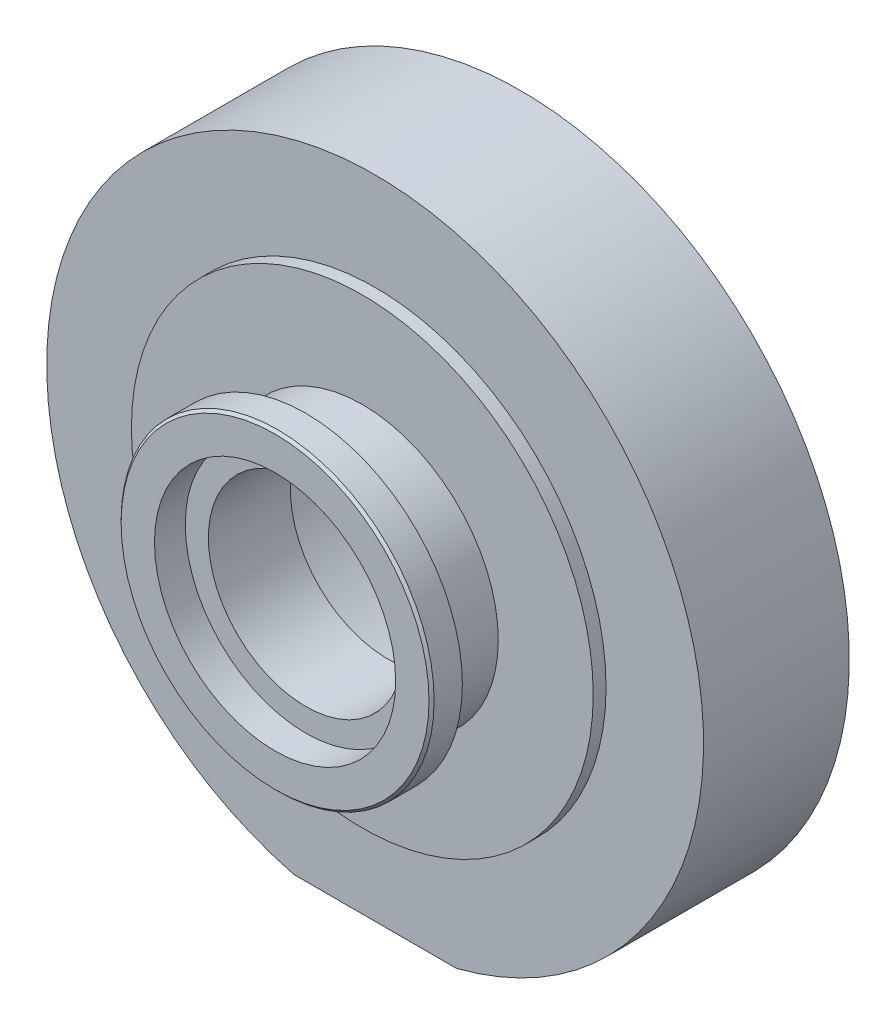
ISO-10303-21;
HEADER;
FILE_DESCRIPTION(('STEP AP214'),'2;1');
FILE_NAME('part.step','',(''),(''),'','','');
FILE_SCHEMA(('AUTOMOTIVE_DESIGN { 1 0 10303 214 1 1 1 1 }'));
ENDSEC;
DATA;
#1=APPLICATION_CONTEXT('core data for automotive mechanical design processes');
#2=APPLICATION_PROTOCOL_DEFINITION('international standard','automotive_design',2000,#1);
#3=PRODUCT_CONTEXT('',#1,'mechanical');
#4=PRODUCT('Part','Part','',(#3));
#5=PRODUCT_RELATED_PRODUCT_CATEGORY('part','',(#4));
#6=PRODUCT_DEFINITION_FORMATION('','',#4);
#7=PRODUCT_DEFINITION_CONTEXT('part definition',#1,'design');
#8=PRODUCT_DEFINITION('design','',#6,#7);
#9=PRODUCT_DEFINITION_SHAPE('','',#8);
#10=(LENGTH_UNIT() NAMED_UNIT(*) SI_UNIT(.MILLI.,.METRE.));
#11=(NAMED_UNIT(*) PLANE_ANGLE_UNIT() SI_UNIT($,.RADIAN.));
#12=(NAMED_UNIT(*) SI_UNIT($,.STERADIAN.) SOLID_ANGLE_UNIT());
#13=UNCERTAINTY_MEASURE_WITH_UNIT(LENGTH_MEASURE(1.E-05),#10,'distance_accuracy_value','');
#14=(GEOMETRIC_REPRESENTATION_CONTEXT(3) GLOBAL_UNCERTAINTY_ASSIGNED_CONTEXT((#13)) GLOBAL_UNIT_ASSIGNED_CONTEXT((#10,
#11,#12)) REPRESENTATION_CONTEXT('',''));
#15=CARTESIAN_POINT('',(0.,0.,0.));
#16=DIRECTION('',(0.,0.,1.));
#17=DIRECTION('',(1.,0.,0.));
#18=AXIS2_PLACEMENT_3D('',#15,#16,#17);
#19=CARTESIAN_POINT('',(0.,0.,-47.9));
#20=DIRECTION('',(0.,0.,1.));
#21=DIRECTION('',(1.,0.,0.));
#22=AXIS2_PLACEMENT_3D('',#19,#20,#21);
#23=CYLINDRICAL_SURFACE('',#22,64.);
#24=CARTESIAN_POINT('',(0.,0.,-47.9));
#25=DIRECTION('',(0.,0.,1.));
#26=DIRECTION('',(1.,0.,0.));
#27=AXIS2_PLACEMENT_3D('',#24,#25,#26);
#28=CIRCLE('',#27,64.);
#29=CARTESIAN_POINT('',(15.8745078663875,-62.,-47.9));
#30=VERTEX_POINT('',#29);
#31=CARTESIAN_POINT('',(-15.8745078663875,-62.,-47.9));
#32=VERTEX_POINT('',#31);
#33=EDGE_CURVE('E100',#30,#32,#28,.T.);
#34=ORIENTED_EDGE('',*,*,#33,.T.);
#35=DIRECTION('',(0.,0.,1.));
#36=VECTOR('',#35,1.);
#37=CARTESIAN_POINT('',(-15.8745078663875,-62.,-47.9));
#38=LINE('',#37,#36);
#39=CARTESIAN_POINT('',(-15.8745078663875,-62.,-19.5));
#40=VERTEX_POINT('',#39);
#41=EDGE_CURVE('E77',#32,#40,#38,.T.);
#42=ORIENTED_EDGE('',*,*,#41,.T.);
#43=CARTESIAN_POINT('',(0.,0.,-19.5));
#44=DIRECTION('',(0.,0.,1.));
#45=DIRECTION('',(1.,0.,0.));
#46=AXIS2_PLACEMENT_3D('',#43,#44,#45);
#47=CIRCLE('',#46,64.);
#48=CARTESIAN_POINT('',(15.8745078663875,-62.,-19.5));
#49=VERTEX_POINT('',#48);
#50=EDGE_CURVE('E97',#49,#40,#47,.T.);
#51=ORIENTED_EDGE('',*,*,#50,.F.);
#52=DIRECTION('',(0.,0.,1.));
#53=VECTOR('',#52,1.);
#54=CARTESIAN_POINT('',(15.8745078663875,-62.,-47.9));
#55=LINE('',#54,#53);
#56=EDGE_CURVE('E50',#49,#30,#55,.F.);
#57=ORIENTED_EDGE('',*,*,#56,.T.);
#58=EDGE_LOOP('',(#34,#42,#51,#57));
#59=FACE_BOUND('',#58,.T.);
#60=CARTESIAN_POINT('',(-25.0067922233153,-58.9123106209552,-31.0499999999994));
#61=CARTESIAN_POINT('',(-25.102425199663,-58.8717164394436,-31.0500046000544));
#62=CARTESIAN_POINT('',(-25.198027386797,-58.8308583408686,-31.0587809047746));
#63=CARTESIAN_POINT('',(-25.3864057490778,-58.7498166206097,-31.093668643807));
#64=CARTESIAN_POINT('',(-25.4791784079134,-58.709633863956,-31.1198007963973));
#65=CARTESIAN_POINT('',(-25.6591684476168,-58.6311922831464,-31.1886542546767));
#66=CARTESIAN_POINT('',(-25.7463885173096,-58.5929325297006,-31.2313674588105));
#67=CARTESIAN_POINT('',(-25.9128535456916,-58.5195036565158,-31.3321589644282));
#68=CARTESIAN_POINT('',(-25.992100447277,-58.4843337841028,-31.3902335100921));
#69=CARTESIAN_POINT('',(-26.140474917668,-58.4181665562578,-31.5201288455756));
#70=CARTESIAN_POINT('',(-26.2095987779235,-58.3871707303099,-31.5919546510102));
#71=CARTESIAN_POINT('',(-26.3357842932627,-58.3303631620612,-31.7473050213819));
#72=CARTESIAN_POINT('',(-26.3928454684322,-58.3045516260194,-31.830830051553));
#73=CARTESIAN_POINT('',(-26.4933393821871,-58.2589566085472,-32.0072221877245));
#74=CARTESIAN_POINT('',(-26.5367699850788,-58.239174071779,-32.1000907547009));
#75=CARTESIAN_POINT('',(-26.6087969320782,-58.2063012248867,-32.2925233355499));
#76=CARTESIAN_POINT('',(-26.6373933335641,-58.1932108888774,-32.3920873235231));
#77=CARTESIAN_POINT('',(-26.6789613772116,-58.1741656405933,-32.5950548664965));
#78=CARTESIAN_POINT('',(-26.6919374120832,-58.168208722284,-32.6984573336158));
#79=CARTESIAN_POINT('',(-26.701923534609,-58.1636253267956,-32.9061912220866));
#80=CARTESIAN_POINT('',(-26.6989336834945,-58.1649988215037,-33.0105226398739));
#81=CARTESIAN_POINT('',(-26.6770734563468,-58.1750280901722,-33.2171200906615));
#82=CARTESIAN_POINT('',(-26.6582078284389,-58.1836816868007,-33.3193867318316));
#83=CARTESIAN_POINT('',(-26.6051193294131,-58.2079760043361,-33.5189849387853));
#84=CARTESIAN_POINT('',(-26.5708964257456,-58.2236167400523,-33.6163164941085));
#85=CARTESIAN_POINT('',(-26.4880255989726,-58.2613642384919,-33.8032984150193));
#86=CARTESIAN_POINT('',(-26.4393754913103,-58.2834719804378,-33.8929476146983));
#87=CARTESIAN_POINT('',(-26.3289886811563,-58.3334210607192,-34.0620072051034));
#88=CARTESIAN_POINT('',(-26.2672519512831,-58.3612624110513,-34.141417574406));
#89=CARTESIAN_POINT('',(-26.1323678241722,-58.4217836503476,-34.2877757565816));
#90=CARTESIAN_POINT('',(-26.0592162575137,-58.4544653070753,-34.354718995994));
#91=CARTESIAN_POINT('',(-25.9035440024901,-58.5236161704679,-34.4742074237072));
#92=CARTESIAN_POINT('',(-25.8210233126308,-58.560085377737,-34.5267526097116));
#93=CARTESIAN_POINT('',(-25.6489092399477,-58.6356741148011,-34.6159528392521));
#94=CARTESIAN_POINT('',(-25.5593157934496,-58.6747936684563,-34.6526077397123));
#95=CARTESIAN_POINT('',(-25.3755674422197,-58.7544942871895,-34.708983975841));
#96=CARTESIAN_POINT('',(-25.2814125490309,-58.7950753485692,-34.7287053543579));
#97=CARTESIAN_POINT('',(-25.0912319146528,-58.876487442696,-34.7506491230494));
#98=CARTESIAN_POINT('',(-24.9952068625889,-58.917318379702,-34.7528778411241));
#99=CARTESIAN_POINT('',(-24.8039776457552,-58.9980802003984,-34.7397895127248));
#100=CARTESIAN_POINT('',(-24.7087734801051,-59.0380110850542,-34.7244724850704));
#101=CARTESIAN_POINT('',(-24.5219194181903,-59.1158668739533,-34.6767326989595));
#102=CARTESIAN_POINT('',(-24.4302689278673,-59.153792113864,-34.644312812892));
#103=CARTESIAN_POINT('',(-24.2531343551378,-59.2266380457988,-34.5632905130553));
#104=CARTESIAN_POINT('',(-24.1676502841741,-59.2615587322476,-34.514688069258));
#105=CARTESIAN_POINT('',(-24.0052895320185,-59.3275127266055,-34.4026640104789));
#106=CARTESIAN_POINT('',(-23.9284153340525,-59.3585449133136,-34.3392381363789));
#107=CARTESIAN_POINT('',(-23.7855302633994,-59.4159447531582,-34.1993739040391));
#108=CARTESIAN_POINT('',(-23.7195194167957,-59.4423123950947,-34.1229355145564));
#109=CARTESIAN_POINT('',(-23.6002653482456,-59.4897605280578,-33.9591889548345));
#110=CARTESIAN_POINT('',(-23.5470258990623,-59.5108394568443,-33.8718775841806));
#111=CARTESIAN_POINT('',(-23.4548979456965,-59.5472100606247,-33.6888798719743));
#112=CARTESIAN_POINT('',(-23.4160094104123,-59.5625017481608,-33.5931935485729));
#113=CARTESIAN_POINT('',(-23.3537307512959,-59.5869481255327,-33.3961774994));
#114=CARTESIAN_POINT('',(-23.3303381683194,-59.5961037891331,-33.294848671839));
#115=CARTESIAN_POINT('',(-23.2997308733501,-59.6080767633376,-33.0894112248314));
#116=CARTESIAN_POINT('',(-23.2925161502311,-59.6108940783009,-32.9853026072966));
#117=CARTESIAN_POINT('',(-23.2944771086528,-59.6101278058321,-32.7773017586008));
#118=CARTESIAN_POINT('',(-23.3036467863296,-59.6065465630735,-32.6734094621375));
#119=CARTESIAN_POINT('',(-23.3380944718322,-59.5930674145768,-32.46875212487));
#120=CARTESIAN_POINT('',(-23.3633725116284,-59.583169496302,-32.3679870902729));
#121=CARTESIAN_POINT('',(-23.4292933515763,-59.5572788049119,-32.1724420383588));
#122=CARTESIAN_POINT('',(-23.4699364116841,-59.5412859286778,-32.0776621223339));
#123=CARTESIAN_POINT('',(-23.5653931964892,-59.5035701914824,-31.896779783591));
#124=CARTESIAN_POINT('',(-23.6202064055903,-59.4818475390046,-31.8106770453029));
#125=CARTESIAN_POINT('',(-23.7424178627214,-59.4331717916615,-31.6495639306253));
#126=CARTESIAN_POINT('',(-23.8098193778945,-59.4062173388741,-31.5745564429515));
#127=CARTESIAN_POINT('',(-23.955258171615,-59.3477188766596,-31.4377697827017));
#128=CARTESIAN_POINT('',(-24.0332980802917,-59.3161737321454,-31.3759938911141));
#129=CARTESIAN_POINT('',(-24.1977797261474,-59.2492644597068,-31.2674142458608));
#130=CARTESIAN_POINT('',(-24.2842267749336,-59.2138979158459,-31.2206200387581));
#131=CARTESIAN_POINT('',(-24.4629234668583,-59.1402965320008,-31.1434301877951));
#132=CARTESIAN_POINT('',(-24.5551660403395,-59.1020651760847,-31.1130149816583));
#133=CARTESIAN_POINT('',(-24.7077886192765,-59.0383711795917,-31.0775101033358));
#134=CARTESIAN_POINT('',(-24.7672356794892,-59.0134581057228,-31.0672067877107));
#135=CARTESIAN_POINT('',(-24.8867232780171,-58.963168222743,-31.0534502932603));
#136=CARTESIAN_POINT('',(-24.9467638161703,-58.9377914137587,-31.0499971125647));
#137=CARTESIAN_POINT('',(-25.0067922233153,-58.9123106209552,-31.0499999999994));
#138=B_SPLINE_CURVE_WITH_KNOTS('',3,(#60,#61,#62,#63,#64,#65,#66,#67,#68,#69,#70,#71,#72,#73,
#74,#75,#76,#77,#78,#79,#80,#81,#82,#83,#84,#85,#86,#87,#88,#89,#90,#91,#92,#93,#94,#95,#96,#97,
#98,#99,#100,#101,#102,#103,#104,#105,#106,#107,#108,#109,#110,#111,#112,#113,#114,#115,#116,
#117,#118,#119,#120,#121,#122,#123,#124,#125,#126,#127,#128,#129,#130,#131,#132,#133,#134,#135,
#136,#137),.UNSPECIFIED.,.T.,.F.,(4,2,2,2,2,2,2,2,2,2,2,2,2,2,2,2,2,2,2,2,2,2,2,2,2,2,2,2,2,2,2,
2,2,2,2,2,2,2,4),(0.,0.311438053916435,0.623248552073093,0.934906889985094,1.24648909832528,
1.55818516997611,1.86989364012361,2.18165092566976,2.49340700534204,2.80507539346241,
3.11674258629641,3.42831659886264,3.73989127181,4.05151314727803,4.3631356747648,
4.67487229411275,4.98660896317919,5.29834843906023,5.61008712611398,5.92171303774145,
6.23333861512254,6.54491187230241,6.8564857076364,7.16814917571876,7.47981339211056,
7.79156956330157,8.10332505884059,8.41503106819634,8.7267368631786,9.03832846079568,
9.34992067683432,9.66151816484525,9.97310431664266,10.284771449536,10.5965157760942,
10.9084583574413,11.220027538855,11.4155159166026,11.6110042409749),.UNSPECIFIED.);
#139=CARTESIAN_POINT('',(-25.0067922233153,-58.9123106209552,-31.0499999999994));
#140=VERTEX_POINT('',#139);
#141=EDGE_CURVE('E11',#140,#140,#138,.T.);
#142=ORIENTED_EDGE('',*,*,#141,.F.);
#143=EDGE_LOOP('',(#142));
#144=FACE_BOUND('',#143,.T.);
#145=ADVANCED_FACE('F31',(#59,#144),#23,.T.);
#146=CARTESIAN_POINT('',(0.,0.,-0.5));
#147=DIRECTION('',(0.,0.,-1.));
#148=DIRECTION('',(-1.,0.,0.));
#149=AXIS2_PLACEMENT_3D('',#146,#147,#148);
#150=CONICAL_SURFACE('',#149,30.5,0.785398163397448);
#151=CARTESIAN_POINT('',(0.,0.,0.));
#152=DIRECTION('',(0.,0.,1.));
#153=DIRECTION('',(1.,0.,0.));
#154=AXIS2_PLACEMENT_3D('',#151,#152,#153);
#155=CIRCLE('',#154,30.);
#156=CARTESIAN_POINT('',(30.,0.,0.));
#157=VERTEX_POINT('',#156);
#158=EDGE_CURVE('E139',#157,#157,#155,.T.);
#159=ORIENTED_EDGE('',*,*,#158,.F.);
#160=EDGE_LOOP('',(#159));
#161=FACE_BOUND('',#160,.T.);
#162=CARTESIAN_POINT('',(0.,0.,-0.5));
#163=DIRECTION('',(0.,0.,1.));
#164=DIRECTION('',(1.,0.,0.));
#165=AXIS2_PLACEMENT_3D('',#162,#163,#164);
#166=CIRCLE('',#165,30.5);
#167=CARTESIAN_POINT('',(30.5,0.,-0.5));
#168=VERTEX_POINT('',#167);
#169=EDGE_CURVE('E79',#168,#168,#166,.T.);
#170=ORIENTED_EDGE('',*,*,#169,.T.);
#171=EDGE_LOOP('',(#170));
#172=FACE_BOUND('',#171,.T.);
#173=ADVANCED_FACE('F33',(#161,#172),#150,.T.);
#174=CARTESIAN_POINT('',(0.,30.,0.));
#175=DIRECTION('',(0.,0.,-1.));
#176=DIRECTION('',(-1.,0.,0.));
#177=AXIS2_PLACEMENT_3D('',#174,#175,#176);
#178=PLANE('',#177);
#179=CARTESIAN_POINT('',(0.,0.,0.));
#180=DIRECTION('',(0.,0.,1.));
#181=DIRECTION('',(1.,0.,0.));
#182=AXIS2_PLACEMENT_3D('',#179,#180,#181);
#183=CIRCLE('',#182,23.5);
#184=CARTESIAN_POINT('',(23.5,0.,0.));
#185=VERTEX_POINT('',#184);
#186=EDGE_CURVE('E136',#185,#185,#183,.T.);
#187=ORIENTED_EDGE('',*,*,#186,.F.);
#188=EDGE_LOOP('',(#187));
#189=FACE_BOUND('',#188,.T.);
#190=ORIENTED_EDGE('',*,*,#158,.T.);
#191=EDGE_LOOP('',(#190));
#192=FACE_BOUND('',#191,.T.);
#193=ADVANCED_FACE('F218',(#189,#192),#178,.F.);
#194=CARTESIAN_POINT('',(0.,0.,-47.9));
#195=DIRECTION('',(0.,0.,1.));
#196=DIRECTION('',(1.,0.,0.));
#197=AXIS2_PLACEMENT_3D('',#194,#195,#196);
#198=CYLINDRICAL_SURFACE('',#197,23.5);
#199=CARTESIAN_POINT('',(0.,0.,-6.));
#200=DIRECTION('',(0.,0.,1.));
#201=DIRECTION('',(1.,0.,0.));
#202=AXIS2_PLACEMENT_3D('',#199,#200,#201);
#203=CIRCLE('',#202,23.5);
#204=CARTESIAN_POINT('',(23.5,0.,-6.));
#205=VERTEX_POINT('',#204);
#206=EDGE_CURVE('E133',#205,#205,#203,.T.);
#207=ORIENTED_EDGE('',*,*,#206,.F.);
#208=EDGE_LOOP('',(#207));
#209=FACE_BOUND('',#208,.T.);
#210=ORIENTED_EDGE('',*,*,#186,.T.);
#211=EDGE_LOOP('',(#210));
#212=FACE_BOUND('',#211,.T.);
#213=ADVANCED_FACE('F212',(#209,#212),#198,.F.);
#214=CARTESIAN_POINT('',(0.,23.5,-6.));
#215=DIRECTION('',(0.,0.,-1.));
#216=DIRECTION('',(-1.,0.,0.));
#217=AXIS2_PLACEMENT_3D('',#214,#215,#216);
#218=PLANE('',#217);
#219=CARTESIAN_POINT('',(0.,0.,-6.));
#220=DIRECTION('',(0.,0.,1.));
#221=DIRECTION('',(1.,0.,0.));
#222=AXIS2_PLACEMENT_3D('',#219,#220,#221);
#223=CIRCLE('',#222,19.);
#224=CARTESIAN_POINT('',(19.,0.,-6.));
#225=VERTEX_POINT('',#224);
#226=EDGE_CURVE('E130',#225,#225,#223,.T.);
#227=ORIENTED_EDGE('',*,*,#226,.F.);
#228=EDGE_LOOP('',(#227));
#229=FACE_BOUND('',#228,.T.);
#230=ORIENTED_EDGE('',*,*,#206,.T.);
#231=EDGE_LOOP('',(#230));
#232=FACE_BOUND('',#231,.T.);
#233=ADVANCED_FACE('F206',(#229,#232),#218,.F.);
#234=CARTESIAN_POINT('',(0.,0.,-47.9));
#235=DIRECTION('',(0.,0.,1.));
#236=DIRECTION('',(1.,0.,0.));
#237=AXIS2_PLACEMENT_3D('',#234,#235,#236);
#238=CYLINDRICAL_SURFACE('',#237,19.);
#239=CARTESIAN_POINT('',(0.,0.,-22.));
#240=DIRECTION('',(0.,0.,1.));
#241=DIRECTION('',(1.,0.,0.));
#242=AXIS2_PLACEMENT_3D('',#239,#240,#241);
#243=CIRCLE('',#242,19.);
#244=CARTESIAN_POINT('',(19.,0.,-22.));
#245=VERTEX_POINT('',#244);
#246=EDGE_CURVE('E127',#245,#245,#243,.T.);
#247=ORIENTED_EDGE('',*,*,#246,.F.);
#248=EDGE_LOOP('',(#247));
#249=FACE_BOUND('',#248,.T.);
#250=ORIENTED_EDGE('',*,*,#226,.T.);
#251=EDGE_LOOP('',(#250));
#252=FACE_BOUND('',#251,.T.);
#253=ADVANCED_FACE('F200',(#249,#252),#238,.F.);
#254=CARTESIAN_POINT('',(0.,19.,-22.));
#255=DIRECTION('',(0.,0.,1.));
#256=DIRECTION('',(1.,0.,0.));
#257=AXIS2_PLACEMENT_3D('',#254,#255,#256);
#258=PLANE('',#257);
#259=CARTESIAN_POINT('',(0.,0.,-22.));
#260=DIRECTION('',(0.,0.,1.));
#261=DIRECTION('',(1.,0.,0.));
#262=AXIS2_PLACEMENT_3D('',#259,#260,#261);
#263=CIRCLE('',#262,26.);
#264=CARTESIAN_POINT('',(26.,0.,-22.));
#265=VERTEX_POINT('',#264);
#266=EDGE_CURVE('E124',#265,#265,#263,.T.);
#267=ORIENTED_EDGE('',*,*,#266,.F.);
#268=EDGE_LOOP('',(#267));
#269=FACE_BOUND('',#268,.T.);
#270=ORIENTED_EDGE('',*,*,#246,.T.);
#271=EDGE_LOOP('',(#270));
#272=FACE_BOUND('',#271,.T.);
#273=ADVANCED_FACE('F194',(#269,#272),#258,.F.);
#274=CARTESIAN_POINT('',(0.,0.,-47.9));
#275=DIRECTION('',(0.,0.,1.));
#276=DIRECTION('',(1.,0.,0.));
#277=AXIS2_PLACEMENT_3D('',#274,#275,#276);
#278=CYLINDRICAL_SURFACE('',#277,26.);
#279=CARTESIAN_POINT('',(0.,0.,-22.5));
#280=DIRECTION('',(0.,0.,1.));
#281=DIRECTION('',(1.,0.,0.));
#282=AXIS2_PLACEMENT_3D('',#279,#280,#281);
#283=CIRCLE('',#282,26.);
#284=CARTESIAN_POINT('',(26.,0.,-22.5));
#285=VERTEX_POINT('',#284);
#286=EDGE_CURVE('E121',#285,#285,#283,.T.);
#287=ORIENTED_EDGE('',*,*,#286,.F.);
#288=EDGE_LOOP('',(#287));
#289=FACE_BOUND('',#288,.T.);
#290=ORIENTED_EDGE('',*,*,#266,.T.);
#291=EDGE_LOOP('',(#290));
#292=FACE_BOUND('',#291,.T.);
#293=ADVANCED_FACE('F188',(#289,#292),#278,.F.);
#294=CARTESIAN_POINT('',(0.,26.,-22.5));
#295=DIRECTION('',(0.,0.,1.));
#296=DIRECTION('',(1.,0.,0.));
#297=AXIS2_PLACEMENT_3D('',#294,#295,#296);
#298=PLANE('',#297);
#299=CARTESIAN_POINT('',(0.,0.,-22.5));
#300=DIRECTION('',(0.,0.,1.));
#301=DIRECTION('',(1.,0.,0.));
#302=AXIS2_PLACEMENT_3D('',#299,#300,#301);
#303=CIRCLE('',#302,41.);
#304=CARTESIAN_POINT('',(41.,0.,-22.5));
#305=VERTEX_POINT('',#304);
#306=EDGE_CURVE('E118',#305,#305,#303,.T.);
#307=ORIENTED_EDGE('',*,*,#306,.F.);
#308=EDGE_LOOP('',(#307));
#309=FACE_BOUND('',#308,.T.);
#310=ORIENTED_EDGE('',*,*,#286,.T.);
#311=EDGE_LOOP('',(#310));
#312=FACE_BOUND('',#311,.T.);
#313=ADVANCED_FACE('F182',(#309,#312),#298,.F.);
#314=CARTESIAN_POINT('',(0.,0.,-47.9));
#315=DIRECTION('',(0.,0.,1.));
#316=DIRECTION('',(1.,0.,0.));
#317=AXIS2_PLACEMENT_3D('',#314,#315,#316);
#318=CYLINDRICAL_SURFACE('',#317,41.);
#319=CARTESIAN_POINT('',(0.,0.,-30.5));
#320=DIRECTION('',(0.,0.,1.));
#321=DIRECTION('',(1.,0.,0.));
#322=AXIS2_PLACEMENT_3D('',#319,#320,#321);
#323=CIRCLE('',#322,41.);
#324=CARTESIAN_POINT('',(41.,0.,-30.5));
#325=VERTEX_POINT('',#324);
#326=EDGE_CURVE('E115',#325,#325,#323,.T.);
#327=ORIENTED_EDGE('',*,*,#326,.F.);
#328=EDGE_LOOP('',(#327));
#329=FACE_BOUND('',#328,.T.);
#330=ORIENTED_EDGE('',*,*,#306,.T.);
#331=EDGE_LOOP('',(#330));
#332=FACE_BOUND('',#331,.T.);
#333=ADVANCED_FACE('F176',(#329,#332),#318,.F.);
#334=CARTESIAN_POINT('',(0.,41.,-30.5));
#335=DIRECTION('',(0.,0.,-1.));
#336=DIRECTION('',(-1.,0.,0.));
#337=AXIS2_PLACEMENT_3D('',#334,#335,#336);
#338=PLANE('',#337);
#339=CARTESIAN_POINT('',(0.,0.,-30.5));
#340=DIRECTION('',(0.,0.,1.));
#341=DIRECTION('',(1.,0.,0.));
#342=AXIS2_PLACEMENT_3D('',#339,#340,#341);
#343=CIRCLE('',#342,37.);
#344=CARTESIAN_POINT('',(37.,0.,-30.5));
#345=VERTEX_POINT('',#344);
#346=EDGE_CURVE('E112',#345,#345,#343,.T.);
#347=ORIENTED_EDGE('',*,*,#346,.F.);
#348=EDGE_LOOP('',(#347));
#349=FACE_BOUND('',#348,.T.);
#350=ORIENTED_EDGE('',*,*,#326,.T.);
#351=EDGE_LOOP('',(#350));
#352=FACE_BOUND('',#351,.T.);
#353=ADVANCED_FACE('F170',(#349,#352),#338,.F.);
#354=CARTESIAN_POINT('',(0.,0.,-47.9));
#355=DIRECTION('',(0.,0.,1.));
#356=DIRECTION('',(1.,0.,0.));
#357=AXIS2_PLACEMENT_3D('',#354,#355,#356);
#358=CYLINDRICAL_SURFACE('',#357,37.);
#359=CARTESIAN_POINT('',(0.,0.,-45.4));
#360=DIRECTION('',(0.,0.,1.));
#361=DIRECTION('',(1.,0.,0.));
#362=AXIS2_PLACEMENT_3D('',#359,#360,#361);
#363=CIRCLE('',#362,37.);
#364=CARTESIAN_POINT('',(37.,0.,-45.4));
#365=VERTEX_POINT('',#364);
#366=EDGE_CURVE('E109',#365,#365,#363,.T.);
#367=ORIENTED_EDGE('',*,*,#366,.F.);
#368=EDGE_LOOP('',(#367));
#369=FACE_BOUND('',#368,.T.);
#370=ORIENTED_EDGE('',*,*,#346,.T.);
#371=EDGE_LOOP('',(#370));
#372=FACE_BOUND('',#371,.T.);
#373=ADVANCED_FACE('F164',(#369,#372),#358,.F.);
#374=CARTESIAN_POINT('',(0.,37.,-45.4));
#375=DIRECTION('',(0.,0.,1.));
#376=DIRECTION('',(1.,0.,0.));
#377=AXIS2_PLACEMENT_3D('',#374,#375,#376);
#378=PLANE('',#377);
#379=CARTESIAN_POINT('',(0.,0.,-45.4));
#380=DIRECTION('',(0.,0.,1.));
#381=DIRECTION('',(1.,0.,0.));
#382=AXIS2_PLACEMENT_3D('',#379,#380,#381);
#383=CIRCLE('',#382,45.);
#384=CARTESIAN_POINT('',(45.,0.,-45.4));
#385=VERTEX_POINT('',#384);
#386=EDGE_CURVE('E106',#385,#385,#383,.T.);
#387=ORIENTED_EDGE('',*,*,#386,.F.);
#388=EDGE_LOOP('',(#387));
#389=FACE_BOUND('',#388,.T.);
#390=ORIENTED_EDGE('',*,*,#366,.T.);
#391=EDGE_LOOP('',(#390));
#392=FACE_BOUND('',#391,.T.);
#393=ADVANCED_FACE('F158',(#389,#392),#378,.F.);
#394=CARTESIAN_POINT('',(0.,0.,-47.9));
#395=DIRECTION('',(0.,0.,1.));
#396=DIRECTION('',(1.,0.,0.));
#397=AXIS2_PLACEMENT_3D('',#394,#395,#396);
#398=CYLINDRICAL_SURFACE('',#397,45.);
#399=CARTESIAN_POINT('',(0.,0.,-47.9));
#400=DIRECTION('',(0.,0.,1.));
#401=DIRECTION('',(1.,0.,0.));
#402=AXIS2_PLACEMENT_3D('',#399,#400,#401);
#403=CIRCLE('',#402,45.);
#404=CARTESIAN_POINT('',(45.,0.,-47.9));
#405=VERTEX_POINT('',#404);
#406=EDGE_CURVE('E103',#405,#405,#403,.T.);
#407=ORIENTED_EDGE('',*,*,#406,.F.);
#408=EDGE_LOOP('',(#407));
#409=FACE_BOUND('',#408,.T.);
#410=ORIENTED_EDGE('',*,*,#386,.T.);
#411=EDGE_LOOP('',(#410));
#412=FACE_BOUND('',#411,.T.);
#413=ADVANCED_FACE('F152',(#409,#412),#398,.F.);
#414=CARTESIAN_POINT('',(0.,45.,-47.9));
#415=DIRECTION('',(0.,0.,1.));
#416=DIRECTION('',(1.,0.,0.));
#417=AXIS2_PLACEMENT_3D('',#414,#415,#416);
#418=PLANE('',#417);
#419=ORIENTED_EDGE('',*,*,#33,.F.);
#420=DIRECTION('',(-1.,0.,0.));
#421=VECTOR('',#420,1.);
#422=CARTESIAN_POINT('',(64.,-62.,-47.9));
#423=LINE('',#422,#421);
#424=EDGE_CURVE('E71',#30,#32,#423,.T.);
#425=ORIENTED_EDGE('',*,*,#424,.T.);
#426=EDGE_LOOP('',(#419,#425));
#427=FACE_BOUND('',#426,.T.);
#428=ORIENTED_EDGE('',*,*,#406,.T.);
#429=EDGE_LOOP('',(#428));
#430=FACE_BOUND('',#429,.T.);
#431=ADVANCED_FACE('F149',(#427,#430),#418,.F.);
#432=CARTESIAN_POINT('',(0.,64.,-19.5));
#433=DIRECTION('',(0.,0.,-1.));
#434=DIRECTION('',(-1.,0.,0.));
#435=AXIS2_PLACEMENT_3D('',#432,#433,#434);
#436=PLANE('',#435);
#437=CARTESIAN_POINT('',(0.,0.,-19.5));
#438=DIRECTION('',(0.,0.,1.));
#439=DIRECTION('',(1.,0.,0.));
#440=AXIS2_PLACEMENT_3D('',#437,#438,#439);
#441=CIRCLE('',#440,45.);
#442=CARTESIAN_POINT('',(45.,0.,-19.5));
#443=VERTEX_POINT('',#442);
#444=EDGE_CURVE('E94',#443,#443,#441,.T.);
#445=ORIENTED_EDGE('',*,*,#444,.F.);
#446=EDGE_LOOP('',(#445));
#447=FACE_BOUND('',#446,.T.);
#448=ORIENTED_EDGE('',*,*,#50,.T.);
#449=DIRECTION('',(1.,0.,0.));
#450=VECTOR('',#449,1.);
#451=CARTESIAN_POINT('',(0.,-62.,-19.5));
#452=LINE('',#451,#450);
#453=EDGE_CURVE('E43',#40,#49,#452,.T.);
#454=ORIENTED_EDGE('',*,*,#453,.T.);
#455=EDGE_LOOP('',(#448,#454));
#456=FACE_BOUND('',#455,.T.);
#457=ADVANCED_FACE('F143',(#447,#456),#436,.F.);
#458=CARTESIAN_POINT('',(0.,0.,-47.9));
#459=DIRECTION('',(0.,0.,1.));
#460=DIRECTION('',(1.,0.,0.));
#461=AXIS2_PLACEMENT_3D('',#458,#459,#460);
#462=CYLINDRICAL_SURFACE('',#461,45.);
#463=CARTESIAN_POINT('',(0.,0.,-17.));
#464=DIRECTION('',(0.,0.,1.));
#465=DIRECTION('',(1.,0.,0.));
#466=AXIS2_PLACEMENT_3D('',#463,#464,#465);
#467=CIRCLE('',#466,45.);
#468=CARTESIAN_POINT('',(45.,0.,-17.));
#469=VERTEX_POINT('',#468);
#470=EDGE_CURVE('E91',#469,#469,#467,.T.);
#471=ORIENTED_EDGE('',*,*,#470,.F.);
#472=EDGE_LOOP('',(#471));
#473=FACE_BOUND('',#472,.T.);
#474=ORIENTED_EDGE('',*,*,#444,.T.);
#475=EDGE_LOOP('',(#474));
#476=FACE_BOUND('',#475,.T.);
#477=ADVANCED_FACE('F251',(#473,#476),#462,.T.);
#478=CARTESIAN_POINT('',(0.,45.,-17.));
#479=DIRECTION('',(0.,0.,-1.));
#480=DIRECTION('',(-1.,0.,0.));
#481=AXIS2_PLACEMENT_3D('',#478,#479,#480);
#482=PLANE('',#481);
#483=CARTESIAN_POINT('',(0.,0.,-17.));
#484=DIRECTION('',(0.,0.,1.));
#485=DIRECTION('',(1.,0.,0.));
#486=AXIS2_PLACEMENT_3D('',#483,#484,#485);
#487=CIRCLE('',#486,26.5);
#488=CARTESIAN_POINT('',(26.5,0.,-17.));
#489=VERTEX_POINT('',#488);
#490=EDGE_CURVE('E88',#489,#489,#487,.T.);
#491=ORIENTED_EDGE('',*,*,#490,.F.);
#492=EDGE_LOOP('',(#491));
#493=FACE_BOUND('',#492,.T.);
#494=ORIENTED_EDGE('',*,*,#470,.T.);
#495=EDGE_LOOP('',(#494));
#496=FACE_BOUND('',#495,.T.);
#497=ADVANCED_FACE('F245',(#493,#496),#482,.F.);
#498=CARTESIAN_POINT('',(0.,0.,-47.9));
#499=DIRECTION('',(0.,0.,1.));
#500=DIRECTION('',(1.,0.,0.));
#501=AXIS2_PLACEMENT_3D('',#498,#499,#500);
#502=CYLINDRICAL_SURFACE('',#501,26.5);
#503=CARTESIAN_POINT('',(0.,0.,-6.));
#504=DIRECTION('',(0.,0.,1.));
#505=DIRECTION('',(1.,0.,0.));
#506=AXIS2_PLACEMENT_3D('',#503,#504,#505);
#507=CIRCLE('',#506,26.5);
#508=CARTESIAN_POINT('',(26.5,0.,-6.));
#509=VERTEX_POINT('',#508);
#510=EDGE_CURVE('E85',#509,#509,#507,.T.);
#511=ORIENTED_EDGE('',*,*,#510,.F.);
#512=EDGE_LOOP('',(#511));
#513=FACE_BOUND('',#512,.T.);
#514=ORIENTED_EDGE('',*,*,#490,.T.);
#515=EDGE_LOOP('',(#514));
#516=FACE_BOUND('',#515,.T.);
#517=ADVANCED_FACE('F239',(#513,#516),#502,.T.);
#518=CARTESIAN_POINT('',(0.,26.5,-6.));
#519=DIRECTION('',(0.,0.,1.));
#520=DIRECTION('',(1.,0.,0.));
#521=AXIS2_PLACEMENT_3D('',#518,#519,#520);
#522=PLANE('',#521);
#523=CARTESIAN_POINT('',(0.,0.,-6.));
#524=DIRECTION('',(0.,0.,1.));
#525=DIRECTION('',(1.,0.,0.));
#526=AXIS2_PLACEMENT_3D('',#523,#524,#525);
#527=CIRCLE('',#526,30.5);
#528=CARTESIAN_POINT('',(30.5,0.,-6.));
#529=VERTEX_POINT('',#528);
#530=EDGE_CURVE('E82',#529,#529,#527,.T.);
#531=ORIENTED_EDGE('',*,*,#530,.F.);
#532=EDGE_LOOP('',(#531));
#533=FACE_BOUND('',#532,.T.);
#534=ORIENTED_EDGE('',*,*,#510,.T.);
#535=EDGE_LOOP('',(#534));
#536=FACE_BOUND('',#535,.T.);
#537=ADVANCED_FACE('F233',(#533,#536),#522,.F.);
#538=CARTESIAN_POINT('',(0.,0.,-47.9));
#539=DIRECTION('',(0.,0.,1.));
#540=DIRECTION('',(1.,0.,0.));
#541=AXIS2_PLACEMENT_3D('',#538,#539,#540);
#542=CYLINDRICAL_SURFACE('',#541,30.5);
#543=ORIENTED_EDGE('',*,*,#169,.F.);
#544=EDGE_LOOP('',(#543));
#545=FACE_BOUND('',#544,.T.);
#546=ORIENTED_EDGE('',*,*,#530,.T.);
#547=EDGE_LOOP('',(#546));
#548=FACE_BOUND('',#547,.T.);
#549=ADVANCED_FACE('F230',(#545,#548),#542,.T.);
#550=CARTESIAN_POINT('',(64.,-62.,-47.9));
#551=DIRECTION('',(0.,1.,0.));
#552=DIRECTION('',(0.,0.,1.));
#553=AXIS2_PLACEMENT_3D('',#550,#551,#552);
#554=PLANE('',#553);
#555=ORIENTED_EDGE('',*,*,#424,.F.);
#556=ORIENTED_EDGE('',*,*,#56,.F.);
#557=ORIENTED_EDGE('',*,*,#453,.F.);
#558=ORIENTED_EDGE('',*,*,#41,.F.);
#559=EDGE_LOOP('',(#555,#556,#557,#558));
#560=FACE_BOUND('',#559,.T.);
#561=ADVANCED_FACE('F147',(#560),#554,.F.);
#562=CARTESIAN_POINT('',(-25.006792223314,-58.912310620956,-32.9));
#563=DIRECTION('',(0.390731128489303,0.920504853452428,0.));
#564=DIRECTION('',(-0.920504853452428,0.390731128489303,0.));
#565=AXIS2_PLACEMENT_3D('',#562,#563,#564);
#566=CYLINDRICAL_SURFACE('',#565,1.85000000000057);
#567=CARTESIAN_POINT('',(-21.6855776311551,-51.0880193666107,-32.9));
#568=DIRECTION('',(0.390731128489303,0.920504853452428,0.));
#569=DIRECTION('',(-0.920504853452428,0.390731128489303,0.));
#570=AXIS2_PLACEMENT_3D('',#567,#568,#569);
#571=CIRCLE('',#570,1.85000000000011);
#572=CARTESIAN_POINT('',(-23.3885116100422,-50.3651667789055,-32.9));
#573=VERTEX_POINT('',#572);
#574=EDGE_CURVE('E69',#573,#573,#571,.T.);
#575=ORIENTED_EDGE('',*,*,#574,.T.);
#576=EDGE_LOOP('',(#575));
#577=FACE_BOUND('',#576,.T.);
#578=ORIENTED_EDGE('',*,*,#141,.T.);
#579=EDGE_LOOP('',(#578));
#580=FACE_BOUND('',#579,.T.);
#581=ADVANCED_FACE('F65',(#577,#580),#566,.F.);
#582=CARTESIAN_POINT('',(-21.6855776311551,-51.0880193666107,-32.9));
#583=DIRECTION('',(-0.390731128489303,-0.920504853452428,0.));
#584=DIRECTION('',(0.920504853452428,-0.390731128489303,0.));
#585=AXIS2_PLACEMENT_3D('',#582,#583,#584);
#586=CONICAL_SURFACE('',#585,1.85000000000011,1.04719755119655);
#587=CARTESIAN_POINT('',(-21.268238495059,-50.104829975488,-32.9));
#588=VERTEX_POINT('',#587);
#589=VERTEX_LOOP('',#588);
#590=FACE_BOUND('',#589,.T.);
#591=ORIENTED_EDGE('',*,*,#574,.F.);
#592=EDGE_LOOP('',(#591));
#593=FACE_BOUND('',#592,.T.);
#594=ADVANCED_FACE('F62',(#590,#593),#586,.F.);
#595=CLOSED_SHELL('',(#145,#173,#193,#213,#233,#253,#273,#293,#313,#333,#353,#373,#393,#413,
#431,#457,#477,#497,#517,#537,#549,#561,#581,#594));
#596=MANIFOLD_SOLID_BREP('B2',#595);
#597=ADVANCED_BREP_SHAPE_REPRESENTATION('',(#18,#596),#14);
#598=SHAPE_DEFINITION_REPRESENTATION(#9,#597);
ENDSEC;
END-ISO-10303-21;
